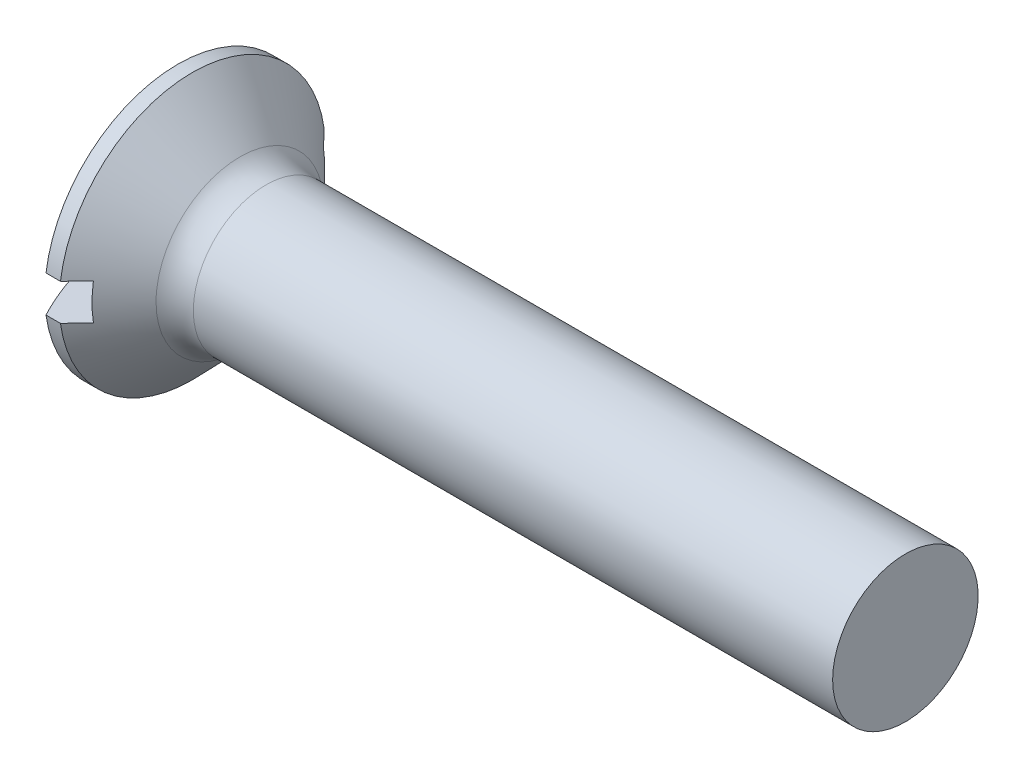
ISO-10303-21;
HEADER;
FILE_DESCRIPTION(('STEP AP214'),'2;1');
FILE_NAME('part.step','',(''),(''),'','','');
FILE_SCHEMA(('AUTOMOTIVE_DESIGN { 1 0 10303 214 1 1 1 1 }'));
ENDSEC;
DATA;
#1=APPLICATION_CONTEXT('core data for automotive mechanical design processes');
#2=APPLICATION_PROTOCOL_DEFINITION('international standard','automotive_design',2000,#1);
#3=PRODUCT_CONTEXT('',#1,'mechanical');
#4=PRODUCT('Part','Part','',(#3));
#5=PRODUCT_RELATED_PRODUCT_CATEGORY('part','',(#4));
#6=PRODUCT_DEFINITION_FORMATION('','',#4);
#7=PRODUCT_DEFINITION_CONTEXT('part definition',#1,'design');
#8=PRODUCT_DEFINITION('design','',#6,#7);
#9=PRODUCT_DEFINITION_SHAPE('','',#8);
#10=(LENGTH_UNIT() NAMED_UNIT(*) SI_UNIT(.MILLI.,.METRE.));
#11=(NAMED_UNIT(*) PLANE_ANGLE_UNIT() SI_UNIT($,.RADIAN.));
#12=(NAMED_UNIT(*) SI_UNIT($,.STERADIAN.) SOLID_ANGLE_UNIT());
#13=UNCERTAINTY_MEASURE_WITH_UNIT(LENGTH_MEASURE(1.E-05),#10,'distance_accuracy_value','');
#14=(GEOMETRIC_REPRESENTATION_CONTEXT(3) GLOBAL_UNCERTAINTY_ASSIGNED_CONTEXT((#13)) GLOBAL_UNIT_ASSIGNED_CONTEXT((#10,
#11,#12)) REPRESENTATION_CONTEXT('',''));
#15=CARTESIAN_POINT('',(0.,0.,0.));
#16=DIRECTION('',(0.,0.,1.));
#17=DIRECTION('',(1.,0.,0.));
#18=AXIS2_PLACEMENT_3D('',#15,#16,#17);
#19=CARTESIAN_POINT('',(19.3505434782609,0.,0.));
#20=DIRECTION('',(-1.,0.,0.));
#21=DIRECTION('',(0.,-1.,0.));
#22=AXIS2_PLACEMENT_3D('',#19,#20,#21);
#23=SPHERICAL_SURFACE('',#22,19.3505434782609);
#24=CARTESIAN_POINT('',(19.3505434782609,1.25,0.));
#25=DIRECTION('',(0.,1.,0.));
#26=DIRECTION('',(0.,0.,1.));
#27=AXIS2_PLACEMENT_3D('',#24,#25,#26);
#28=CIRCLE('',#27,19.3101277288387);
#29=CARTESIAN_POINT('',(2.3,1.25,9.06421535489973));
#30=VERTEX_POINT('',#29);
#31=CARTESIAN_POINT('',(2.3,1.25,-9.06421535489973));
#32=VERTEX_POINT('',#31);
#33=EDGE_CURVE('E184',#30,#32,#28,.F.);
#34=ORIENTED_EDGE('',*,*,#33,.F.);
#35=CARTESIAN_POINT('',(2.3,0.,0.));
#36=DIRECTION('',(-1.,0.,0.));
#37=DIRECTION('',(0.,0.,1.));
#38=AXIS2_PLACEMENT_3D('',#35,#36,#37);
#39=CIRCLE('',#38,9.15);
#40=EDGE_CURVE('E139',#30,#32,#39,.T.);
#41=ORIENTED_EDGE('',*,*,#40,.T.);
#42=EDGE_LOOP('',(#34,#41));
#43=FACE_BOUND('',#42,.T.);
#44=ADVANCED_FACE('F34',(#43),#23,.T.);
#45=CARTESIAN_POINT('',(-15.875,0.,0.));
#46=DIRECTION('',(-1.,0.,0.));
#47=DIRECTION('',(0.,0.,1.));
#48=AXIS2_PLACEMENT_3D('',#45,#46,#47);
#49=CYLINDRICAL_SURFACE('',#48,9.15);
#50=CARTESIAN_POINT('',(3.29239158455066,0.,0.));
#51=DIRECTION('',(-1.,0.,0.));
#52=DIRECTION('',(0.,0.,1.));
#53=AXIS2_PLACEMENT_3D('',#50,#51,#52);
#54=CIRCLE('',#53,9.15);
#55=CARTESIAN_POINT('',(3.29239158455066,1.25,9.06421535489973));
#56=VERTEX_POINT('',#55);
#57=CARTESIAN_POINT('',(3.29239158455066,1.25,-9.06421535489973));
#58=VERTEX_POINT('',#57);
#59=EDGE_CURVE('E110',#56,#58,#54,.T.);
#60=ORIENTED_EDGE('',*,*,#59,.T.);
#61=DIRECTION('',(-1.,0.,0.));
#62=VECTOR('',#61,1.);
#63=CARTESIAN_POINT('',(-15.875,1.25,-9.06421535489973));
#64=LINE('',#63,#62);
#65=EDGE_CURVE('E62',#58,#32,#64,.T.);
#66=ORIENTED_EDGE('',*,*,#65,.T.);
#67=ORIENTED_EDGE('',*,*,#40,.F.);
#68=DIRECTION('',(-1.,0.,0.));
#69=VECTOR('',#68,1.);
#70=CARTESIAN_POINT('',(-15.875,1.25,9.06421535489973));
#71=LINE('',#70,#69);
#72=EDGE_CURVE('E179',#30,#56,#71,.F.);
#73=ORIENTED_EDGE('',*,*,#72,.T.);
#74=EDGE_LOOP('',(#60,#66,#67,#73));
#75=FACE_BOUND('',#74,.T.);
#76=ADVANCED_FACE('F160',(#75),#49,.T.);
#77=CARTESIAN_POINT('',(52.3,0.,0.));
#78=DIRECTION('',(-1.,0.,0.));
#79=DIRECTION('',(0.,0.,1.));
#80=AXIS2_PLACEMENT_3D('',#77,#78,#79);
#81=PLANE('',#80);
#82=CARTESIAN_POINT('',(52.3,0.,0.));
#83=DIRECTION('',(-1.,0.,0.));
#84=DIRECTION('',(0.,0.,1.));
#85=AXIS2_PLACEMENT_3D('',#82,#83,#84);
#86=CIRCLE('',#85,5.);
#87=CARTESIAN_POINT('',(52.3,0.,5.));
#88=VERTEX_POINT('',#87);
#89=EDGE_CURVE('E132',#88,#88,#86,.T.);
#90=ORIENTED_EDGE('',*,*,#89,.F.);
#91=EDGE_LOOP('',(#90));
#92=FACE_BOUND('',#91,.T.);
#93=ADVANCED_FACE('F168',(#92),#81,.F.);
#94=CARTESIAN_POINT('',(19.3505434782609,-1.25,0.));
#95=DIRECTION('',(0.,-1.,0.));
#96=DIRECTION('',(0.,0.,-1.));
#97=AXIS2_PLACEMENT_3D('',#94,#95,#96);
#98=CIRCLE('',#97,19.3101277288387);
#99=CARTESIAN_POINT('',(2.3,-1.25,-9.06421535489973));
#100=VERTEX_POINT('',#99);
#101=CARTESIAN_POINT('',(2.3,-1.25,9.06421535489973));
#102=VERTEX_POINT('',#101);
#103=EDGE_CURVE('E130',#100,#102,#98,.F.);
#104=ORIENTED_EDGE('',*,*,#103,.F.);
#105=EDGE_CURVE('E129',#100,#102,#39,.T.);
#106=ORIENTED_EDGE('',*,*,#105,.T.);
#107=EDGE_LOOP('',(#104,#106));
#108=FACE_BOUND('',#107,.T.);
#109=ADVANCED_FACE('F158',(#108),#23,.T.);
#110=CARTESIAN_POINT('',(3.29239158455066,-1.25,-9.06421535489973));
#111=VERTEX_POINT('',#110);
#112=CARTESIAN_POINT('',(3.29239158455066,-1.25,9.06421535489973));
#113=VERTEX_POINT('',#112);
#114=EDGE_CURVE('E127',#111,#113,#54,.T.);
#115=ORIENTED_EDGE('',*,*,#114,.T.);
#116=DIRECTION('',(-1.,0.,0.));
#117=VECTOR('',#116,1.);
#118=CARTESIAN_POINT('',(-15.875,-1.25,9.06421535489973));
#119=LINE('',#118,#117);
#120=EDGE_CURVE('E177',#113,#102,#119,.T.);
#121=ORIENTED_EDGE('',*,*,#120,.T.);
#122=ORIENTED_EDGE('',*,*,#105,.F.);
#123=DIRECTION('',(-1.,0.,0.));
#124=VECTOR('',#123,1.);
#125=CARTESIAN_POINT('',(-15.875,-1.25,-9.06421535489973));
#126=LINE('',#125,#124);
#127=EDGE_CURVE('E119',#100,#111,#126,.F.);
#128=ORIENTED_EDGE('',*,*,#127,.T.);
#129=EDGE_LOOP('',(#115,#121,#122,#128));
#130=FACE_BOUND('',#129,.T.);
#131=ADVANCED_FACE('F125',(#130),#49,.T.);
#132=CARTESIAN_POINT('',(3.29239158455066,0.,0.));
#133=DIRECTION('',(-1.,0.,0.));
#134=DIRECTION('',(0.,0.,1.));
#135=AXIS2_PLACEMENT_3D('',#132,#133,#134);
#136=CONICAL_SURFACE('',#135,9.15,0.802851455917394);
#137=CARTESIAN_POINT('',(-7.36787282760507,1.25,-20.1502930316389));
#138=CARTESIAN_POINT('',(-6.69350507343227,1.25,-19.4506115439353));
#139=CARTESIAN_POINT('',(-6.01919682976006,1.25,-18.7508726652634));
#140=CARTESIAN_POINT('',(-4.67076330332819,1.25,-17.3511910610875));
#141=CARTESIAN_POINT('',(-3.99663802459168,1.25,-16.6512483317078));
#142=CARTESIAN_POINT('',(-2.64836000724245,1.25,-15.2507849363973));
#143=CARTESIAN_POINT('',(-1.97420739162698,1.25,-14.5502641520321));
#144=CARTESIAN_POINT('',(-0.626337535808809,1.25,-13.1488307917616));
#145=CARTESIAN_POINT('',(0.0473797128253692,1.25,-12.4479182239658));
#146=CARTESIAN_POINT('',(1.40318145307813,1.25,-11.0360296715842));
#147=CARTESIAN_POINT('',(2.08525683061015,1.25,-10.3250449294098));
#148=CARTESIAN_POINT('',(3.10743457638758,1.25,-9.25762964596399));
#149=CARTESIAN_POINT('',(3.44801516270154,1.25,-8.90165712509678));
#150=CARTESIAN_POINT('',(4.12871428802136,1.25,-8.18927467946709));
#151=CARTESIAN_POINT('',(4.46883282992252,1.25,-7.83286475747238));
#152=CARTESIAN_POINT('',(5.14829196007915,1.25,-7.11949705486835));
#153=CARTESIAN_POINT('',(5.48763274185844,1.25,-6.76253945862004));
#154=CARTESIAN_POINT('',(6.16526243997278,1.25,-6.04760928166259));
#155=CARTESIAN_POINT('',(6.50355133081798,1.25,-5.68963667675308));
#156=CARTESIAN_POINT('',(7.00958595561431,1.25,-5.15139850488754));
#157=CARTESIAN_POINT('',(7.17802205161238,1.25,-4.9717822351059));
#158=CARTESIAN_POINT('',(7.51425612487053,1.25,-4.61195368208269));
#159=CARTESIAN_POINT('',(7.68205410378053,1.25,-4.43174140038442));
#160=CARTESIAN_POINT('',(8.01674297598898,1.25,-4.07048894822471));
#161=CARTESIAN_POINT('',(8.18363390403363,1.25,-3.88944880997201));
#162=CARTESIAN_POINT('',(8.51608826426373,1.25,-3.52615462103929));
#163=CARTESIAN_POINT('',(8.68165171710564,1.25,-3.34390058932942));
#164=CARTESIAN_POINT('',(8.88848564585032,1.25,-3.11357045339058));
#165=CARTESIAN_POINT('',(8.93073905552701,1.25,-3.06637694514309));
#166=CARTESIAN_POINT('',(9.01508411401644,1.25,-2.97184538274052));
#167=CARTESIAN_POINT('',(9.057175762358,1.25,-2.92450732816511));
#168=CARTESIAN_POINT('',(9.1831772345,1.25,-2.78224753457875));
#169=CARTESIAN_POINT('',(9.26681217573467,1.25,-2.68708173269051));
#170=CARTESIAN_POINT('',(9.43306760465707,1.25,-2.49593834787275));
#171=CARTESIAN_POINT('',(9.51568851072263,1.25,-2.39996112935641));
#172=CARTESIAN_POINT('',(9.67958437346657,1.25,-2.20686609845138));
#173=CARTESIAN_POINT('',(9.76085938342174,1.25,-2.10974833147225));
#174=CARTESIAN_POINT('',(9.9005960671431,1.25,-1.93938740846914));
#175=CARTESIAN_POINT('',(9.95949428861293,1.25,-1.86650301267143));
#176=CARTESIAN_POINT('',(10.0758667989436,1.25,-1.71960586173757));
#177=CARTESIAN_POINT('',(10.1333411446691,1.25,-1.64559315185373));
#178=CARTESIAN_POINT('',(10.2463982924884,1.25,-1.49597636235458));
#179=CARTESIAN_POINT('',(10.3019784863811,1.25,-1.42037030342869));
#180=CARTESIAN_POINT('',(10.4103142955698,1.25,-1.26716223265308));
#181=CARTESIAN_POINT('',(10.4630705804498,1.25,-1.18956070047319));
#182=CARTESIAN_POINT('',(10.5464453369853,1.25,-1.05956088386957));
#183=CARTESIAN_POINT('',(10.5782944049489,1.25,-1.0079555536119));
#184=CARTESIAN_POINT('',(10.639638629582,1.25,-0.903370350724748));
#185=CARTESIAN_POINT('',(10.6691343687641,1.25,-0.850390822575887));
#186=CARTESIAN_POINT('',(10.724939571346,1.25,-0.742857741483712));
#187=CARTESIAN_POINT('',(10.751253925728,1.25,-0.68830676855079));
#188=CARTESIAN_POINT('',(10.7996409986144,1.25,-0.577384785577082));
#189=CARTESIAN_POINT('',(10.8217163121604,1.25,-0.52101491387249));
#190=CARTESIAN_POINT('',(10.8663784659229,1.25,-0.387946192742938));
#191=CARTESIAN_POINT('',(10.8868829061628,1.25,-0.310497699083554));
#192=CARTESIAN_POINT('',(10.907644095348,1.25,-0.19270294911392));
#193=CARTESIAN_POINT('',(10.912898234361,1.25,-0.153217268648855));
#194=CARTESIAN_POINT('',(10.919823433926,1.25,-0.0739244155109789));
#195=CARTESIAN_POINT('',(10.9214947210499,1.25,-0.0341172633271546));
#196=CARTESIAN_POINT('',(10.9211455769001,1.25,0.0456117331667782));
#197=CARTESIAN_POINT('',(10.9191128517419,1.25,0.0855335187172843));
#198=CARTESIAN_POINT('',(10.9114573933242,1.25,0.165032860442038));
#199=CARTESIAN_POINT('',(10.9058339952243,1.25,0.204610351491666));
#200=CARTESIAN_POINT('',(10.891293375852,1.25,0.283248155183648));
#201=CARTESIAN_POINT('',(10.8823680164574,1.25,0.322306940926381));
#202=CARTESIAN_POINT('',(10.8616470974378,1.25,0.399645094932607));
#203=CARTESIAN_POINT('',(10.8498513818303,1.25,0.437924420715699));
#204=CARTESIAN_POINT('',(10.8072417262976,1.25,0.56198390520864));
#205=CARTESIAN_POINT('',(10.7713713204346,1.25,0.646025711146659));
#206=CARTESIAN_POINT('',(10.6915812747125,1.25,0.810213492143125));
#207=CARTESIAN_POINT('',(10.6476446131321,1.25,0.890350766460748));
#208=CARTESIAN_POINT('',(10.5542210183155,1.25,1.0482473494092));
#209=CARTESIAN_POINT('',(10.5046882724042,1.25,1.12597922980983));
#210=CARTESIAN_POINT('',(10.4278258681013,1.25,1.24077286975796));
#211=CARTESIAN_POINT('',(10.4017909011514,1.25,1.27871902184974));
#212=CARTESIAN_POINT('',(10.3489995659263,1.25,1.35410546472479));
#213=CARTESIAN_POINT('',(10.3222432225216,1.25,1.39154577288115));
#214=CARTESIAN_POINT('',(10.2352363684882,1.25,1.51126478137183));
#215=CARTESIAN_POINT('',(10.1738249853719,1.25,1.59269888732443));
#216=CARTESIAN_POINT('',(10.0490057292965,1.25,1.75402688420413));
#217=CARTESIAN_POINT('',(9.98559758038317,1.25,1.83392055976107));
#218=CARTESIAN_POINT('',(9.85732778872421,1.25,1.99258412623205));
#219=CARTESIAN_POINT('',(9.79246555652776,1.25,2.07135353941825));
#220=CARTESIAN_POINT('',(9.66168292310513,1.25,2.22801031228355));
#221=CARTESIAN_POINT('',(9.59576248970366,1.25,2.30589764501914));
#222=CARTESIAN_POINT('',(9.39660745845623,1.25,2.53878434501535));
#223=CARTESIAN_POINT('',(9.2621805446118,1.25,2.69276289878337));
#224=CARTESIAN_POINT('',(8.9914321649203,1.25,2.99896648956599));
#225=CARTESIAN_POINT('',(8.85511117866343,1.25,3.15119195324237));
#226=CARTESIAN_POINT('',(8.58191228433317,1.25,3.45367994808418));
#227=CARTESIAN_POINT('',(8.4450411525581,1.25,3.60394860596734));
#228=CARTESIAN_POINT('',(8.17041019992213,1.25,3.90368777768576));
#229=CARTESIAN_POINT('',(8.03265032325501,1.25,4.05315824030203));
#230=CARTESIAN_POINT('',(7.75662234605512,1.25,4.35137047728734));
#231=CARTESIAN_POINT('',(7.61835483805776,1.25,4.50011280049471));
#232=CARTESIAN_POINT('',(7.34134695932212,1.25,4.79715027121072));
#233=CARTESIAN_POINT('',(7.20260659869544,1.25,4.94544542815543));
#234=CARTESIAN_POINT('',(6.76726514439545,1.25,5.4096392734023));
#235=CARTESIAN_POINT('',(6.4700263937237,1.25,5.72493976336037));
#236=CARTESIAN_POINT('',(5.87456719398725,1.25,6.35461276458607));
#237=CARTESIAN_POINT('',(5.57634674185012,1.25,6.66898527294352));
#238=CARTESIAN_POINT('',(4.97925465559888,1.25,7.29712036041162));
#239=CARTESIAN_POINT('',(4.68038301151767,1.25,7.61088293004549));
#240=CARTESIAN_POINT('',(4.08219352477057,1.25,8.23798252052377));
#241=CARTESIAN_POINT('',(3.78287568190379,1.25,8.55131954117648));
#242=CARTESIAN_POINT('',(2.88418132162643,1.25,9.49115976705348));
#243=CARTESIAN_POINT('',(2.28433195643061,1.25,10.1172107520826));
#244=CARTESIAN_POINT('',(1.08393480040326,1.25,11.3686338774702));
#245=CARTESIAN_POINT('',(0.483387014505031,1.25,11.994006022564));
#246=CARTESIAN_POINT('',(-0.721164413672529,1.25,13.2474601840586));
#247=CARTESIAN_POINT('',(-1.32517028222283,1.25,13.875540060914));
#248=CARTESIAN_POINT('',(-2.53347876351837,1.25,15.1314171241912));
#249=CARTESIAN_POINT('',(-3.13778137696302,1.25,15.7592143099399));
#250=CARTESIAN_POINT('',(-4.34629869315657,1.25,17.0143069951));
#251=CARTESIAN_POINT('',(-4.95051329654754,1.25,17.6416025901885));
#252=CARTESIAN_POINT('',(-6.15909300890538,1.25,18.8960457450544));
#253=CARTESIAN_POINT('',(-6.76345811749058,1.25,19.5231933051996));
#254=CARTESIAN_POINT('',(-7.36787282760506,1.25,20.1502930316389));
#255=B_SPLINE_CURVE_WITH_KNOTS('',3,(#137,#138,#139,#140,#141,#142,#143,#144,#145,#146,#147,
#148,#149,#150,#151,#152,#153,#154,#155,#156,#157,#158,#159,#160,#161,#162,#163,#164,#165,#166,
#167,#168,#169,#170,#171,#172,#173,#174,#175,#176,#177,#178,#179,#180,#181,#182,#183,#184,#185,
#186,#187,#188,#189,#190,#191,#192,#193,#194,#195,#196,#197,#198,#199,#200,#201,#202,#203,#204,
#205,#206,#207,#208,#209,#210,#211,#212,#213,#214,#215,#216,#217,#218,#219,#220,#221,#222,#223,
#224,#225,#226,#227,#228,#229,#230,#231,#232,#233,#234,#235,#236,#237,#238,#239,#240,#241,#242,
#243,#244,#245,#246,#247,#248,#249,#250,#251,#252,#253,#254),.UNSPECIFIED.,.F.,.F.,(4,2,2,2,2,2,
2,2,2,2,2,2,2,2,2,2,2,2,2,2,2,2,2,2,2,2,2,2,2,2,2,2,2,2,2,2,2,2,2,2,2,2,2,2,2,2,2,2,2,2,2,2,2,2,
2,2,2,2,4),(0.,2.91529323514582,5.83064608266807,8.74730500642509,11.6639056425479,
14.6196675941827,16.0976403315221,17.5756037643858,19.053147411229,20.5307265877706,
21.2694369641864,22.0081454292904,22.7468253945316,23.4854938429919,23.6755282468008,
23.8655632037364,24.2456394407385,24.6255532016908,25.0054518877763,25.2865626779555,
25.567662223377,25.8491343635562,26.1305394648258,26.3124200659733,26.4942555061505,
26.6758077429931,26.8572484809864,27.0965577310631,27.2159190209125,27.3352727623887,
27.4550233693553,27.5747961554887,27.694866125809,27.8149426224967,28.0882939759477,
28.3622289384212,28.6385959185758,28.7766475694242,28.9146944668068,29.2206265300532,
29.5266010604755,29.8327019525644,30.1388121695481,30.7519850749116,31.3650054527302,
31.974778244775,32.5845897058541,33.1938334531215,33.8030642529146,35.103016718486,
36.4029732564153,37.7029498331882,39.0029269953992,41.6040470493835,44.2051488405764,
46.819296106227,49.4334495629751,52.0463359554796,54.6592157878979),.UNSPECIFIED.);
#256=CARTESIAN_POINT('',(4.4,1.25,-7.9048159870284));
#257=VERTEX_POINT('',#256);
#258=EDGE_CURVE('E11',#58,#257,#255,.T.);
#259=ORIENTED_EDGE('',*,*,#258,.F.);
#260=ORIENTED_EDGE('',*,*,#59,.F.);
#261=CARTESIAN_POINT('',(4.4,1.25,7.9048159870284));
#262=VERTEX_POINT('',#261);
#263=EDGE_CURVE('E38',#262,#56,#255,.T.);
#264=ORIENTED_EDGE('',*,*,#263,.F.);
#265=CARTESIAN_POINT('',(4.4,0.,0.));
#266=DIRECTION('',(-1.,0.,0.));
#267=DIRECTION('',(0.,0.,1.));
#268=AXIS2_PLACEMENT_3D('',#265,#266,#267);
#269=CIRCLE('',#268,8.00303790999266);
#270=CARTESIAN_POINT('',(4.4,-1.25,7.9048159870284));
#271=VERTEX_POINT('',#270);
#272=EDGE_CURVE('E91',#262,#271,#269,.F.);
#273=ORIENTED_EDGE('',*,*,#272,.T.);
#274=CARTESIAN_POINT('',(-7.36787282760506,-1.25,20.1502930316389));
#275=CARTESIAN_POINT('',(-6.69350507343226,-1.25,19.4506115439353));
#276=CARTESIAN_POINT('',(-6.01919682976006,-1.25,18.7508726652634));
#277=CARTESIAN_POINT('',(-4.67076330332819,-1.25,17.3511910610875));
#278=CARTESIAN_POINT('',(-3.99663802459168,-1.25,16.6512483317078));
#279=CARTESIAN_POINT('',(-2.64836000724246,-1.25,15.2507849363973));
#280=CARTESIAN_POINT('',(-1.97420739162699,-1.25,14.5502641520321));
#281=CARTESIAN_POINT('',(-0.626337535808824,-1.25,13.1488307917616));
#282=CARTESIAN_POINT('',(0.0473797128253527,-1.25,12.4479182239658));
#283=CARTESIAN_POINT('',(1.40318145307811,-1.25,11.0360296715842));
#284=CARTESIAN_POINT('',(2.08525683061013,-1.25,10.3250449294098));
#285=CARTESIAN_POINT('',(3.10743457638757,-1.25,9.25762964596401));
#286=CARTESIAN_POINT('',(3.44801516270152,-1.25,8.9016571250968));
#287=CARTESIAN_POINT('',(4.12871428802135,-1.25,8.18927467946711));
#288=CARTESIAN_POINT('',(4.4688328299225,-1.25,7.83286475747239));
#289=CARTESIAN_POINT('',(5.14829196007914,-1.25,7.11949705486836));
#290=CARTESIAN_POINT('',(5.48763274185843,-1.25,6.76253945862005));
#291=CARTESIAN_POINT('',(6.16526243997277,-1.25,6.0476092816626));
#292=CARTESIAN_POINT('',(6.50355133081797,-1.25,5.68963667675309));
#293=CARTESIAN_POINT('',(7.00958595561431,-1.25,5.15139850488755));
#294=CARTESIAN_POINT('',(7.17802205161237,-1.25,4.9717822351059));
#295=CARTESIAN_POINT('',(7.51425612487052,-1.25,4.61195368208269));
#296=CARTESIAN_POINT('',(7.68205410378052,-1.25,4.43174140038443));
#297=CARTESIAN_POINT('',(8.01674297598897,-1.25,4.07048894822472));
#298=CARTESIAN_POINT('',(8.18363390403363,-1.25,3.88944880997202));
#299=CARTESIAN_POINT('',(8.51608826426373,-1.25,3.5261546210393));
#300=CARTESIAN_POINT('',(8.68165171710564,-1.25,3.34390058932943));
#301=CARTESIAN_POINT('',(8.88848564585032,-1.25,3.11357045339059));
#302=CARTESIAN_POINT('',(8.930739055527,-1.25,3.0663769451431));
#303=CARTESIAN_POINT('',(9.01508411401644,-1.25,2.97184538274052));
#304=CARTESIAN_POINT('',(9.057175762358,-1.25,2.92450732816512));
#305=CARTESIAN_POINT('',(9.18317723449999,-1.25,2.78224753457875));
#306=CARTESIAN_POINT('',(9.26681217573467,-1.25,2.68708173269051));
#307=CARTESIAN_POINT('',(9.43306760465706,-1.25,2.49593834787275));
#308=CARTESIAN_POINT('',(9.51568851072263,-1.25,2.39996112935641));
#309=CARTESIAN_POINT('',(9.67958437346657,-1.25,2.20686609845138));
#310=CARTESIAN_POINT('',(9.76085938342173,-1.25,2.10974833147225));
#311=CARTESIAN_POINT('',(9.90059606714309,-1.25,1.93938740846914));
#312=CARTESIAN_POINT('',(9.95949428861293,-1.25,1.86650301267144));
#313=CARTESIAN_POINT('',(10.0758667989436,-1.25,1.71960586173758));
#314=CARTESIAN_POINT('',(10.1333411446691,-1.25,1.64559315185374));
#315=CARTESIAN_POINT('',(10.2463982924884,-1.25,1.49597636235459));
#316=CARTESIAN_POINT('',(10.301978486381,-1.25,1.4203703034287));
#317=CARTESIAN_POINT('',(10.4103142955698,-1.25,1.26716223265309));
#318=CARTESIAN_POINT('',(10.4630705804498,-1.25,1.1895607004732));
#319=CARTESIAN_POINT('',(10.5464453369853,-1.25,1.05956088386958));
#320=CARTESIAN_POINT('',(10.5782944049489,-1.25,1.00795555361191));
#321=CARTESIAN_POINT('',(10.639638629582,-1.25,0.903370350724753));
#322=CARTESIAN_POINT('',(10.6691343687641,-1.25,0.850390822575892));
#323=CARTESIAN_POINT('',(10.724939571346,-1.25,0.742857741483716));
#324=CARTESIAN_POINT('',(10.751253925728,-1.25,0.688306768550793));
#325=CARTESIAN_POINT('',(10.7996409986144,-1.25,0.577384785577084));
#326=CARTESIAN_POINT('',(10.8217163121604,-1.25,0.521014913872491));
#327=CARTESIAN_POINT('',(10.8663784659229,-1.25,0.387946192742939));
#328=CARTESIAN_POINT('',(10.8868829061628,-1.25,0.310497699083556));
#329=CARTESIAN_POINT('',(10.907644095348,-1.25,0.192702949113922));
#330=CARTESIAN_POINT('',(10.912898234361,-1.25,0.153217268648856));
#331=CARTESIAN_POINT('',(10.919823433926,-1.25,0.0739244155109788));
#332=CARTESIAN_POINT('',(10.9214947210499,-1.25,0.0341172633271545));
#333=CARTESIAN_POINT('',(10.9211455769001,-1.25,-0.0456117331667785));
#334=CARTESIAN_POINT('',(10.9191128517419,-1.25,-0.0855335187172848));
#335=CARTESIAN_POINT('',(10.9114573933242,-1.25,-0.165032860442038));
#336=CARTESIAN_POINT('',(10.9058339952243,-1.25,-0.204610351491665));
#337=CARTESIAN_POINT('',(10.891293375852,-1.25,-0.283248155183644));
#338=CARTESIAN_POINT('',(10.8823680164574,-1.25,-0.322306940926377));
#339=CARTESIAN_POINT('',(10.8616470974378,-1.25,-0.399645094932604));
#340=CARTESIAN_POINT('',(10.8498513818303,-1.25,-0.437924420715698));
#341=CARTESIAN_POINT('',(10.8072417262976,-1.25,-0.561983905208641));
#342=CARTESIAN_POINT('',(10.7713713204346,-1.25,-0.646025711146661));
#343=CARTESIAN_POINT('',(10.6915812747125,-1.25,-0.810213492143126));
#344=CARTESIAN_POINT('',(10.6476446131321,-1.25,-0.890350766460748));
#345=CARTESIAN_POINT('',(10.5542210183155,-1.25,-1.04824734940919));
#346=CARTESIAN_POINT('',(10.5046882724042,-1.25,-1.12597922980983));
#347=CARTESIAN_POINT('',(10.4278258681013,-1.25,-1.24077286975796));
#348=CARTESIAN_POINT('',(10.4017909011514,-1.25,-1.27871902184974));
#349=CARTESIAN_POINT('',(10.3489995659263,-1.25,-1.35410546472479));
#350=CARTESIAN_POINT('',(10.3222432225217,-1.25,-1.39154577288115));
#351=CARTESIAN_POINT('',(10.2352363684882,-1.25,-1.51126478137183));
#352=CARTESIAN_POINT('',(10.1738249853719,-1.25,-1.59269888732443));
#353=CARTESIAN_POINT('',(10.0490057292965,-1.25,-1.75402688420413));
#354=CARTESIAN_POINT('',(9.98559758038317,-1.25,-1.83392055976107));
#355=CARTESIAN_POINT('',(9.85732778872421,-1.25,-1.99258412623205));
#356=CARTESIAN_POINT('',(9.79246555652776,-1.25,-2.07135353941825));
#357=CARTESIAN_POINT('',(9.66168292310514,-1.25,-2.22801031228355));
#358=CARTESIAN_POINT('',(9.59576248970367,-1.25,-2.30589764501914));
#359=CARTESIAN_POINT('',(9.39660745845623,-1.25,-2.53878434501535));
#360=CARTESIAN_POINT('',(9.2621805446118,-1.25,-2.69276289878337));
#361=CARTESIAN_POINT('',(8.9914321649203,-1.25,-2.99896648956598));
#362=CARTESIAN_POINT('',(8.85511117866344,-1.25,-3.15119195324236));
#363=CARTESIAN_POINT('',(8.58191228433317,-1.25,-3.45367994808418));
#364=CARTESIAN_POINT('',(8.4450411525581,-1.25,-3.60394860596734));
#365=CARTESIAN_POINT('',(8.17041019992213,-1.25,-3.90368777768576));
#366=CARTESIAN_POINT('',(8.03265032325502,-1.25,-4.05315824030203));
#367=CARTESIAN_POINT('',(7.75662234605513,-1.25,-4.35137047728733));
#368=CARTESIAN_POINT('',(7.61835483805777,-1.25,-4.5001128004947));
#369=CARTESIAN_POINT('',(7.34134695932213,-1.25,-4.79715027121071));
#370=CARTESIAN_POINT('',(7.20260659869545,-1.25,-4.94544542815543));
#371=CARTESIAN_POINT('',(6.76726514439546,-1.25,-5.4096392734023));
#372=CARTESIAN_POINT('',(6.4700263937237,-1.25,-5.72493976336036));
#373=CARTESIAN_POINT('',(5.87456719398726,-1.25,-6.35461276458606));
#374=CARTESIAN_POINT('',(5.57634674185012,-1.25,-6.66898527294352));
#375=CARTESIAN_POINT('',(4.97925465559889,-1.25,-7.29712036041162));
#376=CARTESIAN_POINT('',(4.68038301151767,-1.25,-7.61088293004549));
#377=CARTESIAN_POINT('',(4.08219352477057,-1.25,-8.23798252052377));
#378=CARTESIAN_POINT('',(3.78287568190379,-1.25,-8.55131954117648));
#379=CARTESIAN_POINT('',(2.88418132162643,-1.25,-9.49115976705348));
#380=CARTESIAN_POINT('',(2.28433195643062,-1.25,-10.1172107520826));
#381=CARTESIAN_POINT('',(1.08393480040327,-1.25,-11.3686338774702));
#382=CARTESIAN_POINT('',(0.483387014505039,-1.25,-11.994006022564));
#383=CARTESIAN_POINT('',(-0.721164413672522,-1.25,-13.2474601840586));
#384=CARTESIAN_POINT('',(-1.32517028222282,-1.25,-13.875540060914));
#385=CARTESIAN_POINT('',(-2.53347876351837,-1.25,-15.1314171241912));
#386=CARTESIAN_POINT('',(-3.13778137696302,-1.25,-15.7592143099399));
#387=CARTESIAN_POINT('',(-4.34629869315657,-1.25,-17.0143069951));
#388=CARTESIAN_POINT('',(-4.95051329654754,-1.25,-17.6416025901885));
#389=CARTESIAN_POINT('',(-6.15909300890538,-1.25,-18.8960457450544));
#390=CARTESIAN_POINT('',(-6.76345811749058,-1.25,-19.5231933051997));
#391=CARTESIAN_POINT('',(-7.36787282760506,-1.25,-20.1502930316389));
#392=B_SPLINE_CURVE_WITH_KNOTS('',3,(#274,#275,#276,#277,#278,#279,#280,#281,#282,#283,#284,
#285,#286,#287,#288,#289,#290,#291,#292,#293,#294,#295,#296,#297,#298,#299,#300,#301,#302,#303,
#304,#305,#306,#307,#308,#309,#310,#311,#312,#313,#314,#315,#316,#317,#318,#319,#320,#321,#322,
#323,#324,#325,#326,#327,#328,#329,#330,#331,#332,#333,#334,#335,#336,#337,#338,#339,#340,#341,
#342,#343,#344,#345,#346,#347,#348,#349,#350,#351,#352,#353,#354,#355,#356,#357,#358,#359,#360,
#361,#362,#363,#364,#365,#366,#367,#368,#369,#370,#371,#372,#373,#374,#375,#376,#377,#378,#379,
#380,#381,#382,#383,#384,#385,#386,#387,#388,#389,#390,#391),.UNSPECIFIED.,.F.,.F.,(4,2,2,2,2,2,
2,2,2,2,2,2,2,2,2,2,2,2,2,2,2,2,2,2,2,2,2,2,2,2,2,2,2,2,2,2,2,2,2,2,2,2,2,2,2,2,2,2,2,2,2,2,2,2,
2,2,2,2,4),(0.,2.91529323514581,5.83064608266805,8.74730500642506,11.6639056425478,
14.6196675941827,16.0976403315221,17.5756037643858,19.053147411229,20.5307265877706,
21.2694369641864,22.0081454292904,22.7468253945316,23.4854938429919,23.6755282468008,
23.8655632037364,24.2456394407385,24.6255532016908,25.0054518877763,25.2865626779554,
25.567662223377,25.8491343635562,26.1305394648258,26.3124200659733,26.4942555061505,
26.6758077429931,26.8572484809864,27.0965577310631,27.2159190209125,27.3352727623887,
27.4550233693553,27.5747961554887,27.694866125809,27.8149426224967,28.0882939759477,
28.3622289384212,28.6385959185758,28.7766475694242,28.9146944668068,29.2206265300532,
29.5266010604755,29.8327019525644,30.138812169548,30.7519850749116,31.3650054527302,
31.974778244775,32.5845897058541,33.1938334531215,33.8030642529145,35.103016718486,
36.4029732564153,37.7029498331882,39.0029269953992,41.6040470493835,44.2051488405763,
46.819296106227,49.4334495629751,52.0463359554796,54.6592157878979),.UNSPECIFIED.);
#393=EDGE_CURVE('E99',#113,#271,#392,.T.);
#394=ORIENTED_EDGE('',*,*,#393,.F.);
#395=ORIENTED_EDGE('',*,*,#114,.F.);
#396=CARTESIAN_POINT('',(4.4,-1.25,-7.9048159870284));
#397=VERTEX_POINT('',#396);
#398=EDGE_CURVE('E48',#397,#111,#392,.T.);
#399=ORIENTED_EDGE('',*,*,#398,.F.);
#400=EDGE_CURVE('E102',#397,#257,#269,.F.);
#401=ORIENTED_EDGE('',*,*,#400,.T.);
#402=EDGE_LOOP('',(#259,#260,#264,#273,#394,#395,#399,#401));
#403=FACE_BOUND('',#402,.T.);
#404=CARTESIAN_POINT('',(6.56283753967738,0.,0.));
#405=DIRECTION('',(1.,0.,0.));
#406=DIRECTION('',(0.,0.,-1.));
#407=AXIS2_PLACEMENT_3D('',#404,#405,#406);
#408=CIRCLE('',#407,5.76335407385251);
#409=CARTESIAN_POINT('',(6.56283753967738,0.,-5.76335407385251));
#410=VERTEX_POINT('',#409);
#411=EDGE_CURVE('E140',#410,#410,#408,.F.);
#412=ORIENTED_EDGE('',*,*,#411,.T.);
#413=EDGE_LOOP('',(#412));
#414=FACE_BOUND('',#413,.T.);
#415=ADVANCED_FACE('F107',(#403,#414),#136,.T.);
#416=CARTESIAN_POINT('',(-15.875,0.,0.));
#417=DIRECTION('',(-1.,0.,0.));
#418=DIRECTION('',(0.,0.,1.));
#419=AXIS2_PLACEMENT_3D('',#416,#417,#418);
#420=CYLINDRICAL_SURFACE('',#419,5.);
#421=CARTESIAN_POINT('',(8.36118704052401,0.,0.));
#422=DIRECTION('',(-1.,0.,0.));
#423=DIRECTION('',(0.,0.,1.));
#424=AXIS2_PLACEMENT_3D('',#421,#422,#423);
#425=CIRCLE('',#424,5.);
#426=CARTESIAN_POINT('',(8.36118704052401,0.,5.));
#427=VERTEX_POINT('',#426);
#428=EDGE_CURVE('E100',#427,#427,#425,.F.);
#429=ORIENTED_EDGE('',*,*,#428,.T.);
#430=EDGE_LOOP('',(#429));
#431=FACE_BOUND('',#430,.T.);
#432=ORIENTED_EDGE('',*,*,#89,.T.);
#433=EDGE_LOOP('',(#432));
#434=FACE_BOUND('',#433,.T.);
#435=ADVANCED_FACE('F146',(#431,#434),#420,.T.);
#436=CARTESIAN_POINT('',(8.36118704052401,0.,0.));
#437=DIRECTION('',(-1.,0.,0.));
#438=DIRECTION('',(0.,0.,1.));
#439=AXIS2_PLACEMENT_3D('',#436,#437,#438);
#440=TOROIDAL_SURFACE('',#439,7.5,2.5);
#441=ORIENTED_EDGE('',*,*,#428,.F.);
#442=EDGE_LOOP('',(#441));
#443=FACE_BOUND('',#442,.T.);
#444=ORIENTED_EDGE('',*,*,#411,.F.);
#445=EDGE_LOOP('',(#444));
#446=FACE_BOUND('',#445,.T.);
#447=ADVANCED_FACE('F36',(#443,#446),#440,.F.);
#448=CARTESIAN_POINT('',(4.4,1.25,9.15));
#449=DIRECTION('',(0.,1.,0.));
#450=DIRECTION('',(0.,0.,1.));
#451=AXIS2_PLACEMENT_3D('',#448,#449,#450);
#452=PLANE('',#451);
#453=ORIENTED_EDGE('',*,*,#258,.T.);
#454=DIRECTION('',(0.,0.,-1.));
#455=VECTOR('',#454,1.);
#456=CARTESIAN_POINT('',(4.4,1.25,9.15));
#457=LINE('',#456,#455);
#458=EDGE_CURVE('E94',#262,#257,#457,.T.);
#459=ORIENTED_EDGE('',*,*,#458,.F.);
#460=ORIENTED_EDGE('',*,*,#263,.T.);
#461=ORIENTED_EDGE('',*,*,#72,.F.);
#462=ORIENTED_EDGE('',*,*,#33,.T.);
#463=ORIENTED_EDGE('',*,*,#65,.F.);
#464=EDGE_LOOP('',(#453,#459,#460,#461,#462,#463));
#465=FACE_BOUND('',#464,.T.);
#466=ADVANCED_FACE('F103',(#465),#452,.F.);
#467=CARTESIAN_POINT('',(4.4,-1.25,-9.15));
#468=DIRECTION('',(0.,-1.,0.));
#469=DIRECTION('',(0.,0.,-1.));
#470=AXIS2_PLACEMENT_3D('',#467,#468,#469);
#471=PLANE('',#470);
#472=ORIENTED_EDGE('',*,*,#393,.T.);
#473=DIRECTION('',(0.,0.,1.));
#474=VECTOR('',#473,1.);
#475=CARTESIAN_POINT('',(4.4,-1.25,-9.15));
#476=LINE('',#475,#474);
#477=EDGE_CURVE('E55',#397,#271,#476,.T.);
#478=ORIENTED_EDGE('',*,*,#477,.F.);
#479=ORIENTED_EDGE('',*,*,#398,.T.);
#480=ORIENTED_EDGE('',*,*,#127,.F.);
#481=ORIENTED_EDGE('',*,*,#103,.T.);
#482=ORIENTED_EDGE('',*,*,#120,.F.);
#483=EDGE_LOOP('',(#472,#478,#479,#480,#481,#482));
#484=FACE_BOUND('',#483,.T.);
#485=ADVANCED_FACE('F118',(#484),#471,.F.);
#486=CARTESIAN_POINT('',(4.4,1.25,-9.15));
#487=DIRECTION('',(-1.,0.,0.));
#488=DIRECTION('',(0.,0.,1.));
#489=AXIS2_PLACEMENT_3D('',#486,#487,#488);
#490=PLANE('',#489);
#491=ORIENTED_EDGE('',*,*,#477,.T.);
#492=ORIENTED_EDGE('',*,*,#272,.F.);
#493=ORIENTED_EDGE('',*,*,#458,.T.);
#494=ORIENTED_EDGE('',*,*,#400,.F.);
#495=EDGE_LOOP('',(#491,#492,#493,#494));
#496=FACE_BOUND('',#495,.T.);
#497=ADVANCED_FACE('F93',(#496),#490,.T.);
#498=CLOSED_SHELL('',(#44,#76,#93,#109,#131,#415,#435,#447,#466,#485,#497));
#499=MANIFOLD_SOLID_BREP('B2',#498);
#500=ADVANCED_BREP_SHAPE_REPRESENTATION('',(#18,#499),#14);
#501=SHAPE_DEFINITION_REPRESENTATION(#9,#500);
ENDSEC;
END-ISO-10303-21;
